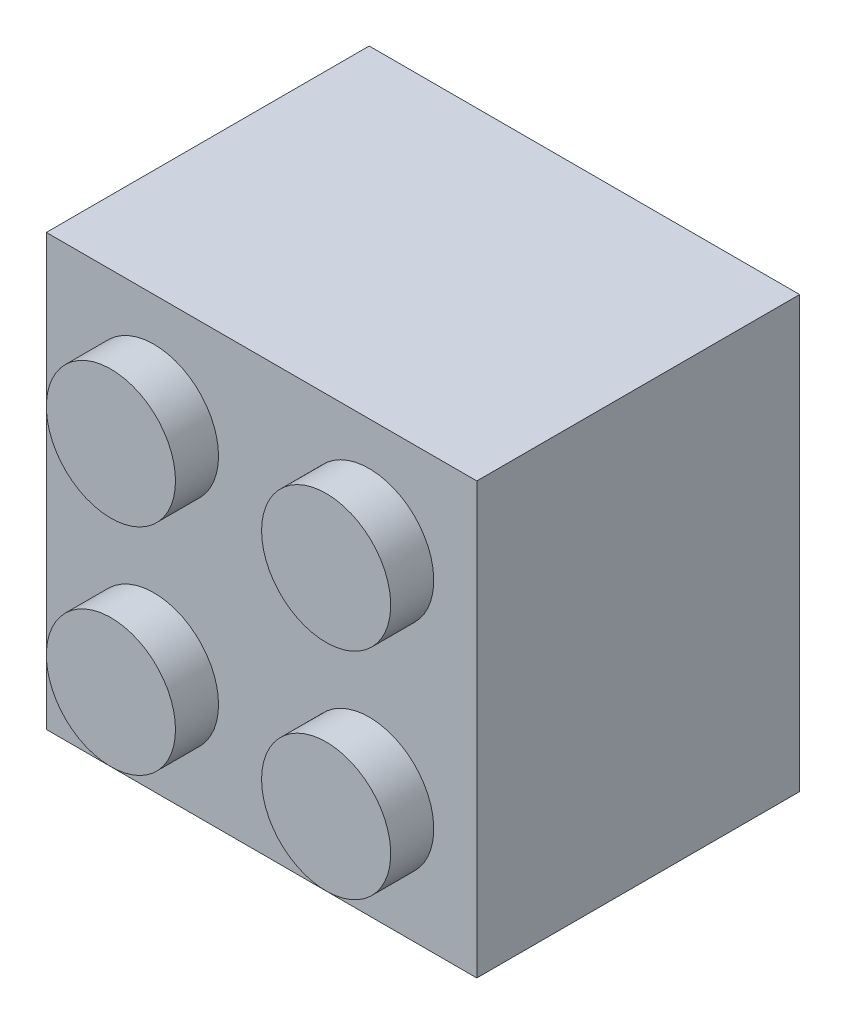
ISO-10303-21;
HEADER;
FILE_DESCRIPTION(('STEP AP214'),'2;1');
FILE_NAME('part.step','',(''),(''),'','','');
FILE_SCHEMA(('AUTOMOTIVE_DESIGN { 1 0 10303 214 1 1 1 1 }'));
ENDSEC;
DATA;
#1=APPLICATION_CONTEXT('core data for automotive mechanical design processes');
#2=APPLICATION_PROTOCOL_DEFINITION('international standard','automotive_design',2000,#1);
#3=PRODUCT_CONTEXT('',#1,'mechanical');
#4=PRODUCT('Part','Part','',(#3));
#5=PRODUCT_RELATED_PRODUCT_CATEGORY('part','',(#4));
#6=PRODUCT_DEFINITION_FORMATION('','',#4);
#7=PRODUCT_DEFINITION_CONTEXT('part definition',#1,'design');
#8=PRODUCT_DEFINITION('design','',#6,#7);
#9=PRODUCT_DEFINITION_SHAPE('','',#8);
#10=(LENGTH_UNIT() NAMED_UNIT(*) SI_UNIT(.MILLI.,.METRE.));
#11=(NAMED_UNIT(*) PLANE_ANGLE_UNIT() SI_UNIT($,.RADIAN.));
#12=(NAMED_UNIT(*) SI_UNIT($,.STERADIAN.) SOLID_ANGLE_UNIT());
#13=UNCERTAINTY_MEASURE_WITH_UNIT(LENGTH_MEASURE(1.E-05),#10,'distance_accuracy_value','');
#14=(GEOMETRIC_REPRESENTATION_CONTEXT(3) GLOBAL_UNCERTAINTY_ASSIGNED_CONTEXT((#13)) GLOBAL_UNIT_ASSIGNED_CONTEXT((#10,
#11,#12)) REPRESENTATION_CONTEXT('',''));
#15=CARTESIAN_POINT('',(0.,0.,0.));
#16=DIRECTION('',(0.,0.,1.));
#17=DIRECTION('',(1.,0.,0.));
#18=AXIS2_PLACEMENT_3D('',#15,#16,#17);
#19=CARTESIAN_POINT('',(0.,0.,19.05));
#20=DIRECTION('',(0.,0.,1.));
#21=DIRECTION('',(1.,0.,0.));
#22=AXIS2_PLACEMENT_3D('',#19,#20,#21);
#23=PLANE('',#22);
#24=DIRECTION('',(0.,-1.,0.));
#25=VECTOR('',#24,1.);
#26=CARTESIAN_POINT('',(-12.7,0.,19.05));
#27=LINE('',#26,#25);
#28=CARTESIAN_POINT('',(-12.7,12.7,19.05));
#29=VERTEX_POINT('',#28);
#30=CARTESIAN_POINT('',(-12.7,-12.7,19.05));
#31=VERTEX_POINT('',#30);
#32=EDGE_CURVE('E32',#29,#31,#27,.T.);
#33=ORIENTED_EDGE('',*,*,#32,.T.);
#34=DIRECTION('',(-1.,0.,0.));
#35=VECTOR('',#34,1.);
#36=CARTESIAN_POINT('',(0.,-12.7,19.05));
#37=LINE('',#36,#35);
#38=CARTESIAN_POINT('',(12.7,-12.7,19.05));
#39=VERTEX_POINT('',#38);
#40=EDGE_CURVE('E267',#39,#31,#37,.T.);
#41=ORIENTED_EDGE('',*,*,#40,.F.);
#42=DIRECTION('',(0.,-1.,0.));
#43=VECTOR('',#42,1.);
#44=CARTESIAN_POINT('',(12.7,0.,19.05));
#45=LINE('',#44,#43);
#46=CARTESIAN_POINT('',(12.7,12.7,19.05));
#47=VERTEX_POINT('',#46);
#48=EDGE_CURVE('E319',#47,#39,#45,.T.);
#49=ORIENTED_EDGE('',*,*,#48,.F.);
#50=DIRECTION('',(-1.,0.,0.));
#51=VECTOR('',#50,1.);
#52=CARTESIAN_POINT('',(0.,12.7,19.05));
#53=LINE('',#52,#51);
#54=EDGE_CURVE('E47',#47,#29,#53,.T.);
#55=ORIENTED_EDGE('',*,*,#54,.T.);
#56=EDGE_LOOP('',(#33,#41,#49,#55));
#57=FACE_BOUND('',#56,.T.);
#58=CARTESIAN_POINT('',(-6.35,6.35,19.05));
#59=DIRECTION('',(0.,0.,1.));
#60=DIRECTION('',(1.,0.,0.));
#61=AXIS2_PLACEMENT_3D('',#58,#59,#60);
#62=CIRCLE('',#61,3.81);
#63=CARTESIAN_POINT('',(-2.54,6.35,19.05));
#64=VERTEX_POINT('',#63);
#65=EDGE_CURVE('E342',#64,#64,#62,.T.);
#66=ORIENTED_EDGE('',*,*,#65,.F.);
#67=EDGE_LOOP('',(#66));
#68=FACE_BOUND('',#67,.T.);
#69=CARTESIAN_POINT('',(6.35,6.35,19.05));
#70=DIRECTION('',(0.,0.,-1.));
#71=DIRECTION('',(-1.,0.,0.));
#72=AXIS2_PLACEMENT_3D('',#69,#70,#71);
#73=CIRCLE('',#72,3.81);
#74=CARTESIAN_POINT('',(2.54,6.35,19.05));
#75=VERTEX_POINT('',#74);
#76=EDGE_CURVE('E293',#75,#75,#73,.T.);
#77=ORIENTED_EDGE('',*,*,#76,.T.);
#78=EDGE_LOOP('',(#77));
#79=FACE_BOUND('',#78,.T.);
#80=CARTESIAN_POINT('',(-6.35,-6.35,19.05));
#81=DIRECTION('',(0.,0.,-1.));
#82=DIRECTION('',(1.,0.,0.));
#83=AXIS2_PLACEMENT_3D('',#80,#81,#82);
#84=CIRCLE('',#83,3.81);
#85=CARTESIAN_POINT('',(-2.54,-6.35,19.05));
#86=VERTEX_POINT('',#85);
#87=EDGE_CURVE('E240',#86,#86,#84,.T.);
#88=ORIENTED_EDGE('',*,*,#87,.T.);
#89=EDGE_LOOP('',(#88));
#90=FACE_BOUND('',#89,.T.);
#91=CARTESIAN_POINT('',(6.35,-6.35,19.05));
#92=DIRECTION('',(0.,0.,1.));
#93=DIRECTION('',(-1.,0.,0.));
#94=AXIS2_PLACEMENT_3D('',#91,#92,#93);
#95=CIRCLE('',#94,3.81);
#96=CARTESIAN_POINT('',(2.54,-6.35,19.05));
#97=VERTEX_POINT('',#96);
#98=EDGE_CURVE('E198',#97,#97,#95,.T.);
#99=ORIENTED_EDGE('',*,*,#98,.F.);
#100=EDGE_LOOP('',(#99));
#101=FACE_BOUND('',#100,.T.);
#102=ADVANCED_FACE('F24',(#57,#68,#79,#90,#101),#23,.T.);
#103=CARTESIAN_POINT('',(0.,12.7,19.05));
#104=DIRECTION('',(0.,-1.,0.));
#105=DIRECTION('',(1.,0.,0.));
#106=AXIS2_PLACEMENT_3D('',#103,#104,#105);
#107=PLANE('',#106);
#108=DIRECTION('',(-1.,0.,0.));
#109=VECTOR('',#108,1.);
#110=CARTESIAN_POINT('',(0.,12.7,0.));
#111=LINE('',#110,#109);
#112=CARTESIAN_POINT('',(12.7,12.7,0.));
#113=VERTEX_POINT('',#112);
#114=CARTESIAN_POINT('',(-12.7,12.7,0.));
#115=VERTEX_POINT('',#114);
#116=EDGE_CURVE('E364',#113,#115,#111,.T.);
#117=ORIENTED_EDGE('',*,*,#116,.T.);
#118=DIRECTION('',(0.,0.,-1.));
#119=VECTOR('',#118,1.);
#120=CARTESIAN_POINT('',(-12.7,12.7,19.05));
#121=LINE('',#120,#119);
#122=EDGE_CURVE('E11',#29,#115,#121,.T.);
#123=ORIENTED_EDGE('',*,*,#122,.F.);
#124=ORIENTED_EDGE('',*,*,#54,.F.);
#125=DIRECTION('',(0.,0.,-1.));
#126=VECTOR('',#125,1.);
#127=CARTESIAN_POINT('',(12.7,12.7,19.05));
#128=LINE('',#127,#126);
#129=EDGE_CURVE('E321',#47,#113,#128,.T.);
#130=ORIENTED_EDGE('',*,*,#129,.T.);
#131=EDGE_LOOP('',(#117,#123,#124,#130));
#132=FACE_BOUND('',#131,.T.);
#133=ADVANCED_FACE('F26',(#132),#107,.F.);
#134=CARTESIAN_POINT('',(-12.7,0.,19.05));
#135=DIRECTION('',(1.,0.,0.));
#136=DIRECTION('',(0.,0.,-1.));
#137=AXIS2_PLACEMENT_3D('',#134,#135,#136);
#138=PLANE('',#137);
#139=DIRECTION('',(0.,-1.,0.));
#140=VECTOR('',#139,1.);
#141=CARTESIAN_POINT('',(-12.7,0.,0.));
#142=LINE('',#141,#140);
#143=CARTESIAN_POINT('',(-12.7,-12.7,0.));
#144=VERTEX_POINT('',#143);
#145=EDGE_CURVE('E366',#115,#144,#142,.T.);
#146=ORIENTED_EDGE('',*,*,#145,.T.);
#147=DIRECTION('',(0.,0.,-1.));
#148=VECTOR('',#147,1.);
#149=CARTESIAN_POINT('',(-12.7,-12.7,19.05));
#150=LINE('',#149,#148);
#151=EDGE_CURVE('E270',#31,#144,#150,.T.);
#152=ORIENTED_EDGE('',*,*,#151,.F.);
#153=ORIENTED_EDGE('',*,*,#32,.F.);
#154=ORIENTED_EDGE('',*,*,#122,.T.);
#155=EDGE_LOOP('',(#146,#152,#153,#154));
#156=FACE_BOUND('',#155,.T.);
#157=ADVANCED_FACE('F373',(#156),#138,.F.);
#158=CARTESIAN_POINT('',(0.,0.,0.));
#159=DIRECTION('',(0.,0.,1.));
#160=DIRECTION('',(1.,0.,0.));
#161=AXIS2_PLACEMENT_3D('',#158,#159,#160);
#162=PLANE('',#161);
#163=DIRECTION('',(1.,0.,0.));
#164=VECTOR('',#163,1.);
#165=CARTESIAN_POINT('',(0.,1.27,0.));
#166=LINE('',#165,#164);
#167=CARTESIAN_POINT('',(-11.43,1.27,0.));
#168=VERTEX_POINT('',#167);
#169=CARTESIAN_POINT('',(-1.27,1.27,0.));
#170=VERTEX_POINT('',#169);
#171=EDGE_CURVE('E329',#168,#170,#166,.T.);
#172=ORIENTED_EDGE('',*,*,#171,.T.);
#173=DIRECTION('',(0.,1.,0.));
#174=VECTOR('',#173,1.);
#175=CARTESIAN_POINT('',(-1.27,0.,0.));
#176=LINE('',#175,#174);
#177=CARTESIAN_POINT('',(-1.27,11.43,0.));
#178=VERTEX_POINT('',#177);
#179=EDGE_CURVE('E350',#170,#178,#176,.T.);
#180=ORIENTED_EDGE('',*,*,#179,.T.);
#181=DIRECTION('',(-1.,0.,0.));
#182=VECTOR('',#181,1.);
#183=CARTESIAN_POINT('',(0.,11.43,0.));
#184=LINE('',#183,#182);
#185=CARTESIAN_POINT('',(-11.43,11.43,0.));
#186=VERTEX_POINT('',#185);
#187=EDGE_CURVE('E353',#178,#186,#184,.T.);
#188=ORIENTED_EDGE('',*,*,#187,.T.);
#189=DIRECTION('',(0.,-1.,0.));
#190=VECTOR('',#189,1.);
#191=CARTESIAN_POINT('',(-11.43,0.,0.));
#192=LINE('',#191,#190);
#193=EDGE_CURVE('E39',#186,#168,#192,.T.);
#194=ORIENTED_EDGE('',*,*,#193,.T.);
#195=EDGE_LOOP('',(#172,#180,#188,#194));
#196=FACE_BOUND('',#195,.T.);
#197=ORIENTED_EDGE('',*,*,#116,.F.);
#198=DIRECTION('',(0.,-1.,0.));
#199=VECTOR('',#198,1.);
#200=CARTESIAN_POINT('',(12.7,0.,0.));
#201=LINE('',#200,#199);
#202=CARTESIAN_POINT('',(12.7,-12.7,0.));
#203=VERTEX_POINT('',#202);
#204=EDGE_CURVE('E317',#113,#203,#201,.T.);
#205=ORIENTED_EDGE('',*,*,#204,.T.);
#206=DIRECTION('',(-1.,0.,0.));
#207=VECTOR('',#206,1.);
#208=CARTESIAN_POINT('',(0.,-12.7,0.));
#209=LINE('',#208,#207);
#210=EDGE_CURVE('E264',#203,#144,#209,.T.);
#211=ORIENTED_EDGE('',*,*,#210,.T.);
#212=ORIENTED_EDGE('',*,*,#145,.F.);
#213=EDGE_LOOP('',(#197,#205,#211,#212));
#214=FACE_BOUND('',#213,.T.);
#215=DIRECTION('',(-1.,0.,0.));
#216=VECTOR('',#215,1.);
#217=CARTESIAN_POINT('',(0.,1.27,0.));
#218=LINE('',#217,#216);
#219=CARTESIAN_POINT('',(11.43,1.27,0.));
#220=VERTEX_POINT('',#219);
#221=CARTESIAN_POINT('',(1.27,1.27,0.));
#222=VERTEX_POINT('',#221);
#223=EDGE_CURVE('E278',#220,#222,#218,.T.);
#224=ORIENTED_EDGE('',*,*,#223,.F.);
#225=DIRECTION('',(0.,-1.,0.));
#226=VECTOR('',#225,1.);
#227=CARTESIAN_POINT('',(11.43,0.,0.));
#228=LINE('',#227,#226);
#229=CARTESIAN_POINT('',(11.43,11.43,0.));
#230=VERTEX_POINT('',#229);
#231=EDGE_CURVE('E307',#230,#220,#228,.T.);
#232=ORIENTED_EDGE('',*,*,#231,.F.);
#233=DIRECTION('',(1.,0.,0.));
#234=VECTOR('',#233,1.);
#235=CARTESIAN_POINT('',(0.,11.43,0.));
#236=LINE('',#235,#234);
#237=CARTESIAN_POINT('',(1.27,11.43,0.));
#238=VERTEX_POINT('',#237);
#239=EDGE_CURVE('E304',#238,#230,#236,.T.);
#240=ORIENTED_EDGE('',*,*,#239,.F.);
#241=DIRECTION('',(0.,1.,0.));
#242=VECTOR('',#241,1.);
#243=CARTESIAN_POINT('',(1.27,0.,0.));
#244=LINE('',#243,#242);
#245=EDGE_CURVE('E301',#222,#238,#244,.T.);
#246=ORIENTED_EDGE('',*,*,#245,.F.);
#247=EDGE_LOOP('',(#224,#232,#240,#246));
#248=FACE_BOUND('',#247,.T.);
#249=DIRECTION('',(1.,0.,0.));
#250=VECTOR('',#249,1.);
#251=CARTESIAN_POINT('',(0.,-1.27,0.));
#252=LINE('',#251,#250);
#253=CARTESIAN_POINT('',(-11.43,-1.27,0.));
#254=VERTEX_POINT('',#253);
#255=CARTESIAN_POINT('',(-1.27,-1.27,0.));
#256=VERTEX_POINT('',#255);
#257=EDGE_CURVE('E225',#254,#256,#252,.T.);
#258=ORIENTED_EDGE('',*,*,#257,.F.);
#259=DIRECTION('',(0.,1.,0.));
#260=VECTOR('',#259,1.);
#261=CARTESIAN_POINT('',(-11.43,0.,0.));
#262=LINE('',#261,#260);
#263=CARTESIAN_POINT('',(-11.43,-11.43,0.));
#264=VERTEX_POINT('',#263);
#265=EDGE_CURVE('E254',#264,#254,#262,.T.);
#266=ORIENTED_EDGE('',*,*,#265,.F.);
#267=DIRECTION('',(-1.,0.,0.));
#268=VECTOR('',#267,1.);
#269=CARTESIAN_POINT('',(0.,-11.43,0.));
#270=LINE('',#269,#268);
#271=CARTESIAN_POINT('',(-1.27,-11.43,0.));
#272=VERTEX_POINT('',#271);
#273=EDGE_CURVE('E251',#272,#264,#270,.T.);
#274=ORIENTED_EDGE('',*,*,#273,.F.);
#275=DIRECTION('',(0.,-1.,0.));
#276=VECTOR('',#275,1.);
#277=CARTESIAN_POINT('',(-1.27,0.,0.));
#278=LINE('',#277,#276);
#279=EDGE_CURVE('E248',#256,#272,#278,.T.);
#280=ORIENTED_EDGE('',*,*,#279,.F.);
#281=EDGE_LOOP('',(#258,#266,#274,#280));
#282=FACE_BOUND('',#281,.T.);
#283=DIRECTION('',(-1.,0.,0.));
#284=VECTOR('',#283,1.);
#285=CARTESIAN_POINT('',(0.,-1.27,0.));
#286=LINE('',#285,#284);
#287=CARTESIAN_POINT('',(11.43,-1.27,0.));
#288=VERTEX_POINT('',#287);
#289=CARTESIAN_POINT('',(1.27,-1.27,0.));
#290=VERTEX_POINT('',#289);
#291=EDGE_CURVE('E207',#288,#290,#286,.T.);
#292=ORIENTED_EDGE('',*,*,#291,.T.);
#293=DIRECTION('',(0.,-1.,0.));
#294=VECTOR('',#293,1.);
#295=CARTESIAN_POINT('',(1.27,0.,0.));
#296=LINE('',#295,#294);
#297=CARTESIAN_POINT('',(1.27,-11.43,0.));
#298=VERTEX_POINT('',#297);
#299=EDGE_CURVE('E203',#290,#298,#296,.T.);
#300=ORIENTED_EDGE('',*,*,#299,.T.);
#301=DIRECTION('',(1.,0.,0.));
#302=VECTOR('',#301,1.);
#303=CARTESIAN_POINT('',(0.,-11.43,0.));
#304=LINE('',#303,#302);
#305=CARTESIAN_POINT('',(11.43,-11.43,0.));
#306=VERTEX_POINT('',#305);
#307=EDGE_CURVE('E206',#298,#306,#304,.T.);
#308=ORIENTED_EDGE('',*,*,#307,.T.);
#309=DIRECTION('',(0.,1.,0.));
#310=VECTOR('',#309,1.);
#311=CARTESIAN_POINT('',(11.43,0.,0.));
#312=LINE('',#311,#310);
#313=EDGE_CURVE('E169',#306,#288,#312,.T.);
#314=ORIENTED_EDGE('',*,*,#313,.T.);
#315=EDGE_LOOP('',(#292,#300,#308,#314));
#316=FACE_BOUND('',#315,.T.);
#317=ADVANCED_FACE('F385',(#196,#214,#248,#282,#316),#162,.F.);
#318=CARTESIAN_POINT('',(-6.35,6.35,21.59));
#319=DIRECTION('',(0.,0.,-1.));
#320=DIRECTION('',(-1.,0.,0.));
#321=AXIS2_PLACEMENT_3D('',#318,#319,#320);
#322=CYLINDRICAL_SURFACE('',#321,3.81);
#323=CARTESIAN_POINT('',(-6.35,6.35,21.59));
#324=DIRECTION('',(0.,0.,1.));
#325=DIRECTION('',(1.,0.,0.));
#326=AXIS2_PLACEMENT_3D('',#323,#324,#325);
#327=CIRCLE('',#326,3.81);
#328=CARTESIAN_POINT('',(-2.54,6.35,21.59));
#329=VERTEX_POINT('',#328);
#330=EDGE_CURVE('E361',#329,#329,#327,.T.);
#331=ORIENTED_EDGE('',*,*,#330,.F.);
#332=EDGE_LOOP('',(#331));
#333=FACE_BOUND('',#332,.T.);
#334=ORIENTED_EDGE('',*,*,#65,.T.);
#335=EDGE_LOOP('',(#334));
#336=FACE_BOUND('',#335,.T.);
#337=ADVANCED_FACE('F388',(#333,#336),#322,.T.);
#338=CARTESIAN_POINT('',(-6.35,6.35,21.59));
#339=DIRECTION('',(0.,0.,1.));
#340=DIRECTION('',(1.,0.,0.));
#341=AXIS2_PLACEMENT_3D('',#338,#339,#340);
#342=PLANE('',#341);
#343=ORIENTED_EDGE('',*,*,#330,.T.);
#344=EDGE_LOOP('',(#343));
#345=FACE_BOUND('',#344,.T.);
#346=ADVANCED_FACE('F614',(#345),#342,.T.);
#347=CARTESIAN_POINT('',(0.,0.,17.78));
#348=DIRECTION('',(0.,0.,1.));
#349=DIRECTION('',(1.,0.,0.));
#350=AXIS2_PLACEMENT_3D('',#347,#348,#349);
#351=PLANE('',#350);
#352=DIRECTION('',(0.,1.,0.));
#353=VECTOR('',#352,1.);
#354=CARTESIAN_POINT('',(-1.27,0.,17.78));
#355=LINE('',#354,#353);
#356=CARTESIAN_POINT('',(-1.27,1.27,17.78));
#357=VERTEX_POINT('',#356);
#358=CARTESIAN_POINT('',(-1.27,11.43,17.78));
#359=VERTEX_POINT('',#358);
#360=EDGE_CURVE('E325',#357,#359,#355,.T.);
#361=ORIENTED_EDGE('',*,*,#360,.F.);
#362=DIRECTION('',(1.,0.,0.));
#363=VECTOR('',#362,1.);
#364=CARTESIAN_POINT('',(0.,1.27,17.78));
#365=LINE('',#364,#363);
#366=CARTESIAN_POINT('',(-11.43,1.27,17.78));
#367=VERTEX_POINT('',#366);
#368=EDGE_CURVE('E333',#367,#357,#365,.T.);
#369=ORIENTED_EDGE('',*,*,#368,.F.);
#370=DIRECTION('',(0.,-1.,0.));
#371=VECTOR('',#370,1.);
#372=CARTESIAN_POINT('',(-11.43,0.,17.78));
#373=LINE('',#372,#371);
#374=CARTESIAN_POINT('',(-11.43,11.43,17.78));
#375=VERTEX_POINT('',#374);
#376=EDGE_CURVE('E331',#375,#367,#373,.T.);
#377=ORIENTED_EDGE('',*,*,#376,.F.);
#378=DIRECTION('',(-1.,0.,0.));
#379=VECTOR('',#378,1.);
#380=CARTESIAN_POINT('',(0.,11.43,17.78));
#381=LINE('',#380,#379);
#382=EDGE_CURVE('E328',#359,#375,#381,.T.);
#383=ORIENTED_EDGE('',*,*,#382,.F.);
#384=EDGE_LOOP('',(#361,#369,#377,#383));
#385=FACE_BOUND('',#384,.T.);
#386=CARTESIAN_POINT('',(-6.35,6.35,17.78));
#387=DIRECTION('',(0.,0.,1.));
#388=DIRECTION('',(1.,0.,0.));
#389=AXIS2_PLACEMENT_3D('',#386,#387,#388);
#390=CIRCLE('',#389,2.54);
#391=CARTESIAN_POINT('',(-3.81,6.35,17.78));
#392=VERTEX_POINT('',#391);
#393=EDGE_CURVE('E324',#392,#392,#390,.T.);
#394=ORIENTED_EDGE('',*,*,#393,.T.);
#395=EDGE_LOOP('',(#394));
#396=FACE_BOUND('',#395,.T.);
#397=ADVANCED_FACE('F610',(#385,#396),#351,.F.);
#398=CARTESIAN_POINT('',(-1.27,0.,19.05));
#399=DIRECTION('',(-1.,0.,0.));
#400=DIRECTION('',(0.,0.,1.));
#401=AXIS2_PLACEMENT_3D('',#398,#399,#400);
#402=PLANE('',#401);
#403=ORIENTED_EDGE('',*,*,#179,.F.);
#404=DIRECTION('',(0.,0.,-1.));
#405=VECTOR('',#404,1.);
#406=CARTESIAN_POINT('',(-1.27,1.27,19.05));
#407=LINE('',#406,#405);
#408=EDGE_CURVE('E335',#357,#170,#407,.T.);
#409=ORIENTED_EDGE('',*,*,#408,.F.);
#410=ORIENTED_EDGE('',*,*,#360,.T.);
#411=DIRECTION('',(0.,0.,-1.));
#412=VECTOR('',#411,1.);
#413=CARTESIAN_POINT('',(-1.27,11.43,19.05));
#414=LINE('',#413,#412);
#415=EDGE_CURVE('E339',#359,#178,#414,.T.);
#416=ORIENTED_EDGE('',*,*,#415,.T.);
#417=EDGE_LOOP('',(#403,#409,#410,#416));
#418=FACE_BOUND('',#417,.T.);
#419=ADVANCED_FACE('F613',(#418),#402,.T.);
#420=CARTESIAN_POINT('',(0.,11.43,19.05));
#421=DIRECTION('',(0.,-1.,0.));
#422=DIRECTION('',(1.,0.,0.));
#423=AXIS2_PLACEMENT_3D('',#420,#421,#422);
#424=PLANE('',#423);
#425=ORIENTED_EDGE('',*,*,#187,.F.);
#426=ORIENTED_EDGE('',*,*,#415,.F.);
#427=ORIENTED_EDGE('',*,*,#382,.T.);
#428=DIRECTION('',(0.,0.,-1.));
#429=VECTOR('',#428,1.);
#430=CARTESIAN_POINT('',(-11.43,11.43,19.05));
#431=LINE('',#430,#429);
#432=EDGE_CURVE('E343',#375,#186,#431,.T.);
#433=ORIENTED_EDGE('',*,*,#432,.T.);
#434=EDGE_LOOP('',(#425,#426,#427,#433));
#435=FACE_BOUND('',#434,.T.);
#436=ADVANCED_FACE('F618',(#435),#424,.T.);
#437=CARTESIAN_POINT('',(-11.43,0.,19.05));
#438=DIRECTION('',(1.,0.,0.));
#439=DIRECTION('',(0.,0.,-1.));
#440=AXIS2_PLACEMENT_3D('',#437,#438,#439);
#441=PLANE('',#440);
#442=ORIENTED_EDGE('',*,*,#193,.F.);
#443=ORIENTED_EDGE('',*,*,#432,.F.);
#444=ORIENTED_EDGE('',*,*,#376,.T.);
#445=DIRECTION('',(0.,0.,-1.));
#446=VECTOR('',#445,1.);
#447=CARTESIAN_POINT('',(-11.43,1.27,19.05));
#448=LINE('',#447,#446);
#449=EDGE_CURVE('E345',#367,#168,#448,.T.);
#450=ORIENTED_EDGE('',*,*,#449,.T.);
#451=EDGE_LOOP('',(#442,#443,#444,#450));
#452=FACE_BOUND('',#451,.T.);
#453=ADVANCED_FACE('F622',(#452),#441,.T.);
#454=CARTESIAN_POINT('',(0.,1.27,19.05));
#455=DIRECTION('',(0.,1.,0.));
#456=DIRECTION('',(-1.,0.,0.));
#457=AXIS2_PLACEMENT_3D('',#454,#455,#456);
#458=PLANE('',#457);
#459=ORIENTED_EDGE('',*,*,#171,.F.);
#460=ORIENTED_EDGE('',*,*,#449,.F.);
#461=ORIENTED_EDGE('',*,*,#368,.T.);
#462=ORIENTED_EDGE('',*,*,#408,.T.);
#463=EDGE_LOOP('',(#459,#460,#461,#462));
#464=FACE_BOUND('',#463,.T.);
#465=ADVANCED_FACE('F626',(#464),#458,.T.);
#466=CARTESIAN_POINT('',(-6.35,6.35,21.59));
#467=DIRECTION('',(0.,0.,-1.));
#468=DIRECTION('',(-1.,0.,0.));
#469=AXIS2_PLACEMENT_3D('',#466,#467,#468);
#470=CYLINDRICAL_SURFACE('',#469,2.54);
#471=CARTESIAN_POINT('',(-6.35,6.35,20.32));
#472=DIRECTION('',(0.,0.,1.));
#473=DIRECTION('',(1.,0.,0.));
#474=AXIS2_PLACEMENT_3D('',#471,#472,#473);
#475=CIRCLE('',#474,2.54);
#476=CARTESIAN_POINT('',(-3.81,6.35,20.32));
#477=VERTEX_POINT('',#476);
#478=EDGE_CURVE('E338',#477,#477,#475,.T.);
#479=ORIENTED_EDGE('',*,*,#478,.T.);
#480=EDGE_LOOP('',(#479));
#481=FACE_BOUND('',#480,.T.);
#482=ORIENTED_EDGE('',*,*,#393,.F.);
#483=EDGE_LOOP('',(#482));
#484=FACE_BOUND('',#483,.T.);
#485=ADVANCED_FACE('F629',(#481,#484),#470,.F.);
#486=CARTESIAN_POINT('',(-6.35,6.35,20.32));
#487=DIRECTION('',(0.,0.,1.));
#488=DIRECTION('',(1.,0.,0.));
#489=AXIS2_PLACEMENT_3D('',#486,#487,#488);
#490=PLANE('',#489);
#491=ORIENTED_EDGE('',*,*,#478,.F.);
#492=EDGE_LOOP('',(#491));
#493=FACE_BOUND('',#492,.T.);
#494=ADVANCED_FACE('F437',(#493),#490,.F.);
#495=CARTESIAN_POINT('',(12.7,0.,19.05));
#496=DIRECTION('',(-1.,0.,0.));
#497=DIRECTION('',(0.,0.,-1.));
#498=AXIS2_PLACEMENT_3D('',#495,#496,#497);
#499=PLANE('',#498);
#500=ORIENTED_EDGE('',*,*,#204,.F.);
#501=ORIENTED_EDGE('',*,*,#129,.F.);
#502=ORIENTED_EDGE('',*,*,#48,.T.);
#503=DIRECTION('',(0.,0.,-1.));
#504=VECTOR('',#503,1.);
#505=CARTESIAN_POINT('',(12.7,-12.7,19.05));
#506=LINE('',#505,#504);
#507=EDGE_CURVE('E217',#39,#203,#506,.T.);
#508=ORIENTED_EDGE('',*,*,#507,.T.);
#509=EDGE_LOOP('',(#500,#501,#502,#508));
#510=FACE_BOUND('',#509,.T.);
#511=ADVANCED_FACE('F381',(#510),#499,.F.);
#512=CARTESIAN_POINT('',(6.35,6.35,21.59));
#513=DIRECTION('',(0.,0.,-1.));
#514=DIRECTION('',(1.,0.,0.));
#515=AXIS2_PLACEMENT_3D('',#512,#513,#514);
#516=CYLINDRICAL_SURFACE('',#515,3.81);
#517=CARTESIAN_POINT('',(6.35,6.35,21.59));
#518=DIRECTION('',(0.,0.,-1.));
#519=DIRECTION('',(-1.,0.,0.));
#520=AXIS2_PLACEMENT_3D('',#517,#518,#519);
#521=CIRCLE('',#520,3.81);
#522=CARTESIAN_POINT('',(2.54,6.35,21.59));
#523=VERTEX_POINT('',#522);
#524=EDGE_CURVE('E314',#523,#523,#521,.T.);
#525=ORIENTED_EDGE('',*,*,#524,.T.);
#526=EDGE_LOOP('',(#525));
#527=FACE_BOUND('',#526,.T.);
#528=ORIENTED_EDGE('',*,*,#76,.F.);
#529=EDGE_LOOP('',(#528));
#530=FACE_BOUND('',#529,.T.);
#531=ADVANCED_FACE('F436',(#527,#530),#516,.T.);
#532=CARTESIAN_POINT('',(6.35,6.35,21.59));
#533=DIRECTION('',(0.,0.,1.));
#534=DIRECTION('',(-1.,0.,0.));
#535=AXIS2_PLACEMENT_3D('',#532,#533,#534);
#536=PLANE('',#535);
#537=ORIENTED_EDGE('',*,*,#524,.F.);
#538=EDGE_LOOP('',(#537));
#539=FACE_BOUND('',#538,.T.);
#540=ADVANCED_FACE('F580',(#539),#536,.T.);
#541=CARTESIAN_POINT('',(0.,0.,17.78));
#542=DIRECTION('',(0.,0.,1.));
#543=DIRECTION('',(-1.,0.,0.));
#544=AXIS2_PLACEMENT_3D('',#541,#542,#543);
#545=PLANE('',#544);
#546=DIRECTION('',(0.,1.,0.));
#547=VECTOR('',#546,1.);
#548=CARTESIAN_POINT('',(1.27,0.,17.78));
#549=LINE('',#548,#547);
#550=CARTESIAN_POINT('',(1.27,1.27,17.78));
#551=VERTEX_POINT('',#550);
#552=CARTESIAN_POINT('',(1.27,11.43,17.78));
#553=VERTEX_POINT('',#552);
#554=EDGE_CURVE('E274',#551,#553,#549,.T.);
#555=ORIENTED_EDGE('',*,*,#554,.T.);
#556=DIRECTION('',(1.,0.,0.));
#557=VECTOR('',#556,1.);
#558=CARTESIAN_POINT('',(0.,11.43,17.78));
#559=LINE('',#558,#557);
#560=CARTESIAN_POINT('',(11.43,11.43,17.78));
#561=VERTEX_POINT('',#560);
#562=EDGE_CURVE('E277',#553,#561,#559,.T.);
#563=ORIENTED_EDGE('',*,*,#562,.T.);
#564=DIRECTION('',(0.,-1.,0.));
#565=VECTOR('',#564,1.);
#566=CARTESIAN_POINT('',(11.43,0.,17.78));
#567=LINE('',#566,#565);
#568=CARTESIAN_POINT('',(11.43,1.27,17.78));
#569=VERTEX_POINT('',#568);
#570=EDGE_CURVE('E281',#561,#569,#567,.T.);
#571=ORIENTED_EDGE('',*,*,#570,.T.);
#572=DIRECTION('',(-1.,0.,0.));
#573=VECTOR('',#572,1.);
#574=CARTESIAN_POINT('',(0.,1.27,17.78));
#575=LINE('',#574,#573);
#576=EDGE_CURVE('E284',#569,#551,#575,.T.);
#577=ORIENTED_EDGE('',*,*,#576,.T.);
#578=EDGE_LOOP('',(#555,#563,#571,#577));
#579=FACE_BOUND('',#578,.T.);
#580=CARTESIAN_POINT('',(6.35,6.35,17.78));
#581=DIRECTION('',(0.,0.,-1.));
#582=DIRECTION('',(-1.,0.,0.));
#583=AXIS2_PLACEMENT_3D('',#580,#581,#582);
#584=CIRCLE('',#583,2.54);
#585=CARTESIAN_POINT('',(3.81,6.35,17.78));
#586=VERTEX_POINT('',#585);
#587=EDGE_CURVE('E273',#586,#586,#584,.T.);
#588=ORIENTED_EDGE('',*,*,#587,.F.);
#589=EDGE_LOOP('',(#588));
#590=FACE_BOUND('',#589,.T.);
#591=ADVANCED_FACE('F576',(#579,#590),#545,.F.);
#592=CARTESIAN_POINT('',(1.27,0.,19.05));
#593=DIRECTION('',(1.,0.,0.));
#594=DIRECTION('',(0.,0.,1.));
#595=AXIS2_PLACEMENT_3D('',#592,#593,#594);
#596=PLANE('',#595);
#597=ORIENTED_EDGE('',*,*,#245,.T.);
#598=DIRECTION('',(0.,0.,-1.));
#599=VECTOR('',#598,1.);
#600=CARTESIAN_POINT('',(1.27,11.43,19.05));
#601=LINE('',#600,#599);
#602=EDGE_CURVE('E291',#553,#238,#601,.T.);
#603=ORIENTED_EDGE('',*,*,#602,.F.);
#604=ORIENTED_EDGE('',*,*,#554,.F.);
#605=DIRECTION('',(0.,0.,-1.));
#606=VECTOR('',#605,1.);
#607=CARTESIAN_POINT('',(1.27,1.27,19.05));
#608=LINE('',#607,#606);
#609=EDGE_CURVE('E287',#551,#222,#608,.T.);
#610=ORIENTED_EDGE('',*,*,#609,.T.);
#611=EDGE_LOOP('',(#597,#603,#604,#610));
#612=FACE_BOUND('',#611,.T.);
#613=ADVANCED_FACE('F579',(#612),#596,.T.);
#614=CARTESIAN_POINT('',(0.,11.43,19.05));
#615=DIRECTION('',(0.,-1.,0.));
#616=DIRECTION('',(-1.,0.,0.));
#617=AXIS2_PLACEMENT_3D('',#614,#615,#616);
#618=PLANE('',#617);
#619=ORIENTED_EDGE('',*,*,#239,.T.);
#620=DIRECTION('',(0.,0.,-1.));
#621=VECTOR('',#620,1.);
#622=CARTESIAN_POINT('',(11.43,11.43,19.05));
#623=LINE('',#622,#621);
#624=EDGE_CURVE('E294',#561,#230,#623,.T.);
#625=ORIENTED_EDGE('',*,*,#624,.F.);
#626=ORIENTED_EDGE('',*,*,#562,.F.);
#627=ORIENTED_EDGE('',*,*,#602,.T.);
#628=EDGE_LOOP('',(#619,#625,#626,#627));
#629=FACE_BOUND('',#628,.T.);
#630=ADVANCED_FACE('F584',(#629),#618,.T.);
#631=CARTESIAN_POINT('',(11.43,0.,19.05));
#632=DIRECTION('',(-1.,0.,0.));
#633=DIRECTION('',(0.,0.,-1.));
#634=AXIS2_PLACEMENT_3D('',#631,#632,#633);
#635=PLANE('',#634);
#636=ORIENTED_EDGE('',*,*,#231,.T.);
#637=DIRECTION('',(0.,0.,-1.));
#638=VECTOR('',#637,1.);
#639=CARTESIAN_POINT('',(11.43,1.27,19.05));
#640=LINE('',#639,#638);
#641=EDGE_CURVE('E296',#569,#220,#640,.T.);
#642=ORIENTED_EDGE('',*,*,#641,.F.);
#643=ORIENTED_EDGE('',*,*,#570,.F.);
#644=ORIENTED_EDGE('',*,*,#624,.T.);
#645=EDGE_LOOP('',(#636,#642,#643,#644));
#646=FACE_BOUND('',#645,.T.);
#647=ADVANCED_FACE('F588',(#646),#635,.T.);
#648=CARTESIAN_POINT('',(0.,1.27,19.05));
#649=DIRECTION('',(0.,1.,0.));
#650=DIRECTION('',(1.,0.,0.));
#651=AXIS2_PLACEMENT_3D('',#648,#649,#650);
#652=PLANE('',#651);
#653=ORIENTED_EDGE('',*,*,#223,.T.);
#654=ORIENTED_EDGE('',*,*,#609,.F.);
#655=ORIENTED_EDGE('',*,*,#576,.F.);
#656=ORIENTED_EDGE('',*,*,#641,.T.);
#657=EDGE_LOOP('',(#653,#654,#655,#656));
#658=FACE_BOUND('',#657,.T.);
#659=ADVANCED_FACE('F592',(#658),#652,.T.);
#660=CARTESIAN_POINT('',(6.35,6.35,21.59));
#661=DIRECTION('',(0.,0.,-1.));
#662=DIRECTION('',(1.,0.,0.));
#663=AXIS2_PLACEMENT_3D('',#660,#661,#662);
#664=CYLINDRICAL_SURFACE('',#663,2.54);
#665=CARTESIAN_POINT('',(6.35,6.35,20.32));
#666=DIRECTION('',(0.,0.,-1.));
#667=DIRECTION('',(-1.,0.,0.));
#668=AXIS2_PLACEMENT_3D('',#665,#666,#667);
#669=CIRCLE('',#668,2.54);
#670=CARTESIAN_POINT('',(3.81,6.35,20.32));
#671=VERTEX_POINT('',#670);
#672=EDGE_CURVE('E290',#671,#671,#669,.T.);
#673=ORIENTED_EDGE('',*,*,#672,.F.);
#674=EDGE_LOOP('',(#673));
#675=FACE_BOUND('',#674,.T.);
#676=ORIENTED_EDGE('',*,*,#587,.T.);
#677=EDGE_LOOP('',(#676));
#678=FACE_BOUND('',#677,.T.);
#679=ADVANCED_FACE('F596',(#675,#678),#664,.F.);
#680=CARTESIAN_POINT('',(6.35,6.35,20.32));
#681=DIRECTION('',(0.,0.,1.));
#682=DIRECTION('',(-1.,0.,0.));
#683=AXIS2_PLACEMENT_3D('',#680,#681,#682);
#684=PLANE('',#683);
#685=ORIENTED_EDGE('',*,*,#672,.T.);
#686=EDGE_LOOP('',(#685));
#687=FACE_BOUND('',#686,.T.);
#688=ADVANCED_FACE('F447',(#687),#684,.F.);
#689=CARTESIAN_POINT('',(0.,-12.7,19.05));
#690=DIRECTION('',(0.,1.,0.));
#691=DIRECTION('',(1.,0.,0.));
#692=AXIS2_PLACEMENT_3D('',#689,#690,#691);
#693=PLANE('',#692);
#694=ORIENTED_EDGE('',*,*,#210,.F.);
#695=ORIENTED_EDGE('',*,*,#507,.F.);
#696=ORIENTED_EDGE('',*,*,#40,.T.);
#697=ORIENTED_EDGE('',*,*,#151,.T.);
#698=EDGE_LOOP('',(#694,#695,#696,#697));
#699=FACE_BOUND('',#698,.T.);
#700=ADVANCED_FACE('F378',(#699),#693,.F.);
#701=CARTESIAN_POINT('',(-6.35,-6.35,21.59));
#702=DIRECTION('',(0.,0.,-1.));
#703=DIRECTION('',(-1.,0.,0.));
#704=AXIS2_PLACEMENT_3D('',#701,#702,#703);
#705=CYLINDRICAL_SURFACE('',#704,3.81);
#706=CARTESIAN_POINT('',(-6.35,-6.35,21.59));
#707=DIRECTION('',(0.,0.,-1.));
#708=DIRECTION('',(1.,0.,0.));
#709=AXIS2_PLACEMENT_3D('',#706,#707,#708);
#710=CIRCLE('',#709,3.81);
#711=CARTESIAN_POINT('',(-2.54,-6.35,21.59));
#712=VERTEX_POINT('',#711);
#713=EDGE_CURVE('E261',#712,#712,#710,.T.);
#714=ORIENTED_EDGE('',*,*,#713,.T.);
#715=EDGE_LOOP('',(#714));
#716=FACE_BOUND('',#715,.T.);
#717=ORIENTED_EDGE('',*,*,#87,.F.);
#718=EDGE_LOOP('',(#717));
#719=FACE_BOUND('',#718,.T.);
#720=ADVANCED_FACE('F446',(#716,#719),#705,.T.);
#721=CARTESIAN_POINT('',(-6.35,-6.35,21.59));
#722=DIRECTION('',(0.,0.,1.));
#723=DIRECTION('',(1.,0.,0.));
#724=AXIS2_PLACEMENT_3D('',#721,#722,#723);
#725=PLANE('',#724);
#726=ORIENTED_EDGE('',*,*,#713,.F.);
#727=EDGE_LOOP('',(#726));
#728=FACE_BOUND('',#727,.T.);
#729=ADVANCED_FACE('F454',(#728),#725,.T.);
#730=CARTESIAN_POINT('',(0.,0.,17.78));
#731=DIRECTION('',(0.,0.,1.));
#732=DIRECTION('',(1.,0.,0.));
#733=AXIS2_PLACEMENT_3D('',#730,#731,#732);
#734=PLANE('',#733);
#735=DIRECTION('',(0.,-1.,0.));
#736=VECTOR('',#735,1.);
#737=CARTESIAN_POINT('',(-1.27,0.,17.78));
#738=LINE('',#737,#736);
#739=CARTESIAN_POINT('',(-1.27,-1.27,17.78));
#740=VERTEX_POINT('',#739);
#741=CARTESIAN_POINT('',(-1.27,-11.43,17.78));
#742=VERTEX_POINT('',#741);
#743=EDGE_CURVE('E221',#740,#742,#738,.T.);
#744=ORIENTED_EDGE('',*,*,#743,.T.);
#745=DIRECTION('',(-1.,0.,0.));
#746=VECTOR('',#745,1.);
#747=CARTESIAN_POINT('',(0.,-11.43,17.78));
#748=LINE('',#747,#746);
#749=CARTESIAN_POINT('',(-11.43,-11.43,17.78));
#750=VERTEX_POINT('',#749);
#751=EDGE_CURVE('E224',#742,#750,#748,.T.);
#752=ORIENTED_EDGE('',*,*,#751,.T.);
#753=DIRECTION('',(0.,1.,0.));
#754=VECTOR('',#753,1.);
#755=CARTESIAN_POINT('',(-11.43,0.,17.78));
#756=LINE('',#755,#754);
#757=CARTESIAN_POINT('',(-11.43,-1.27,17.78));
#758=VERTEX_POINT('',#757);
#759=EDGE_CURVE('E228',#750,#758,#756,.T.);
#760=ORIENTED_EDGE('',*,*,#759,.T.);
#761=DIRECTION('',(1.,0.,0.));
#762=VECTOR('',#761,1.);
#763=CARTESIAN_POINT('',(0.,-1.27,17.78));
#764=LINE('',#763,#762);
#765=EDGE_CURVE('E231',#758,#740,#764,.T.);
#766=ORIENTED_EDGE('',*,*,#765,.T.);
#767=EDGE_LOOP('',(#744,#752,#760,#766));
#768=FACE_BOUND('',#767,.T.);
#769=CARTESIAN_POINT('',(-6.35,-6.35,17.78));
#770=DIRECTION('',(0.,0.,-1.));
#771=DIRECTION('',(1.,0.,0.));
#772=AXIS2_PLACEMENT_3D('',#769,#770,#771);
#773=CIRCLE('',#772,2.54);
#774=CARTESIAN_POINT('',(-3.81,-6.35,17.78));
#775=VERTEX_POINT('',#774);
#776=EDGE_CURVE('E220',#775,#775,#773,.T.);
#777=ORIENTED_EDGE('',*,*,#776,.F.);
#778=EDGE_LOOP('',(#777));
#779=FACE_BOUND('',#778,.T.);
#780=ADVANCED_FACE('F462',(#768,#779),#734,.F.);
#781=CARTESIAN_POINT('',(-1.27,0.,19.05));
#782=DIRECTION('',(-1.,0.,0.));
#783=DIRECTION('',(0.,0.,1.));
#784=AXIS2_PLACEMENT_3D('',#781,#782,#783);
#785=PLANE('',#784);
#786=ORIENTED_EDGE('',*,*,#279,.T.);
#787=DIRECTION('',(0.,0.,-1.));
#788=VECTOR('',#787,1.);
#789=CARTESIAN_POINT('',(-1.27,-11.43,19.05));
#790=LINE('',#789,#788);
#791=EDGE_CURVE('E238',#742,#272,#790,.T.);
#792=ORIENTED_EDGE('',*,*,#791,.F.);
#793=ORIENTED_EDGE('',*,*,#743,.F.);
#794=DIRECTION('',(0.,0.,-1.));
#795=VECTOR('',#794,1.);
#796=CARTESIAN_POINT('',(-1.27,-1.27,19.05));
#797=LINE('',#796,#795);
#798=EDGE_CURVE('E234',#740,#256,#797,.T.);
#799=ORIENTED_EDGE('',*,*,#798,.T.);
#800=EDGE_LOOP('',(#786,#792,#793,#799));
#801=FACE_BOUND('',#800,.T.);
#802=ADVANCED_FACE('F470',(#801),#785,.T.);
#803=CARTESIAN_POINT('',(0.,-11.43,19.05));
#804=DIRECTION('',(0.,1.,0.));
#805=DIRECTION('',(1.,0.,0.));
#806=AXIS2_PLACEMENT_3D('',#803,#804,#805);
#807=PLANE('',#806);
#808=ORIENTED_EDGE('',*,*,#273,.T.);
#809=DIRECTION('',(0.,0.,-1.));
#810=VECTOR('',#809,1.);
#811=CARTESIAN_POINT('',(-11.43,-11.43,19.05));
#812=LINE('',#811,#810);
#813=EDGE_CURVE('E241',#750,#264,#812,.T.);
#814=ORIENTED_EDGE('',*,*,#813,.F.);
#815=ORIENTED_EDGE('',*,*,#751,.F.);
#816=ORIENTED_EDGE('',*,*,#791,.T.);
#817=EDGE_LOOP('',(#808,#814,#815,#816));
#818=FACE_BOUND('',#817,.T.);
#819=ADVANCED_FACE('F478',(#818),#807,.T.);
#820=CARTESIAN_POINT('',(-11.43,0.,19.05));
#821=DIRECTION('',(1.,0.,0.));
#822=DIRECTION('',(0.,0.,-1.));
#823=AXIS2_PLACEMENT_3D('',#820,#821,#822);
#824=PLANE('',#823);
#825=ORIENTED_EDGE('',*,*,#265,.T.);
#826=DIRECTION('',(0.,0.,-1.));
#827=VECTOR('',#826,1.);
#828=CARTESIAN_POINT('',(-11.43,-1.27,19.05));
#829=LINE('',#828,#827);
#830=EDGE_CURVE('E243',#758,#254,#829,.T.);
#831=ORIENTED_EDGE('',*,*,#830,.F.);
#832=ORIENTED_EDGE('',*,*,#759,.F.);
#833=ORIENTED_EDGE('',*,*,#813,.T.);
#834=EDGE_LOOP('',(#825,#831,#832,#833));
#835=FACE_BOUND('',#834,.T.);
#836=ADVANCED_FACE('F486',(#835),#824,.T.);
#837=CARTESIAN_POINT('',(0.,-1.27,19.05));
#838=DIRECTION('',(0.,-1.,0.));
#839=DIRECTION('',(-1.,0.,0.));
#840=AXIS2_PLACEMENT_3D('',#837,#838,#839);
#841=PLANE('',#840);
#842=ORIENTED_EDGE('',*,*,#257,.T.);
#843=ORIENTED_EDGE('',*,*,#798,.F.);
#844=ORIENTED_EDGE('',*,*,#765,.F.);
#845=ORIENTED_EDGE('',*,*,#830,.T.);
#846=EDGE_LOOP('',(#842,#843,#844,#845));
#847=FACE_BOUND('',#846,.T.);
#848=ADVANCED_FACE('F494',(#847),#841,.T.);
#849=CARTESIAN_POINT('',(-6.35,-6.35,21.59));
#850=DIRECTION('',(0.,0.,-1.));
#851=DIRECTION('',(-1.,0.,0.));
#852=AXIS2_PLACEMENT_3D('',#849,#850,#851);
#853=CYLINDRICAL_SURFACE('',#852,2.54);
#854=CARTESIAN_POINT('',(-6.35,-6.35,20.32));
#855=DIRECTION('',(0.,0.,-1.));
#856=DIRECTION('',(1.,0.,0.));
#857=AXIS2_PLACEMENT_3D('',#854,#855,#856);
#858=CIRCLE('',#857,2.54);
#859=CARTESIAN_POINT('',(-3.81,-6.35,20.32));
#860=VERTEX_POINT('',#859);
#861=EDGE_CURVE('E237',#860,#860,#858,.T.);
#862=ORIENTED_EDGE('',*,*,#861,.F.);
#863=EDGE_LOOP('',(#862));
#864=FACE_BOUND('',#863,.T.);
#865=ORIENTED_EDGE('',*,*,#776,.T.);
#866=EDGE_LOOP('',(#865));
#867=FACE_BOUND('',#866,.T.);
#868=ADVANCED_FACE('F502',(#864,#867),#853,.F.);
#869=CARTESIAN_POINT('',(-6.35,-6.35,20.32));
#870=DIRECTION('',(0.,0.,1.));
#871=DIRECTION('',(1.,0.,0.));
#872=AXIS2_PLACEMENT_3D('',#869,#870,#871);
#873=PLANE('',#872);
#874=ORIENTED_EDGE('',*,*,#861,.T.);
#875=EDGE_LOOP('',(#874));
#876=FACE_BOUND('',#875,.T.);
#877=ADVANCED_FACE('F510',(#876),#873,.F.);
#878=CARTESIAN_POINT('',(6.35,-6.35,21.59));
#879=DIRECTION('',(0.,0.,-1.));
#880=DIRECTION('',(1.,0.,0.));
#881=AXIS2_PLACEMENT_3D('',#878,#879,#880);
#882=CYLINDRICAL_SURFACE('',#881,3.81);
#883=CARTESIAN_POINT('',(6.35,-6.35,21.59));
#884=DIRECTION('',(0.,0.,1.));
#885=DIRECTION('',(-1.,0.,0.));
#886=AXIS2_PLACEMENT_3D('',#883,#884,#885);
#887=CIRCLE('',#886,3.81);
#888=CARTESIAN_POINT('',(2.54,-6.35,21.59));
#889=VERTEX_POINT('',#888);
#890=EDGE_CURVE('E214',#889,#889,#887,.T.);
#891=ORIENTED_EDGE('',*,*,#890,.F.);
#892=EDGE_LOOP('',(#891));
#893=FACE_BOUND('',#892,.T.);
#894=ORIENTED_EDGE('',*,*,#98,.T.);
#895=EDGE_LOOP('',(#894));
#896=FACE_BOUND('',#895,.T.);
#897=ADVANCED_FACE('F518',(#893,#896),#882,.T.);
#898=CARTESIAN_POINT('',(6.35,-6.35,21.59));
#899=DIRECTION('',(0.,0.,1.));
#900=DIRECTION('',(-1.,0.,0.));
#901=AXIS2_PLACEMENT_3D('',#898,#899,#900);
#902=PLANE('',#901);
#903=ORIENTED_EDGE('',*,*,#890,.T.);
#904=EDGE_LOOP('',(#903));
#905=FACE_BOUND('',#904,.T.);
#906=ADVANCED_FACE('F412',(#905),#902,.T.);
#907=CARTESIAN_POINT('',(0.,0.,17.78));
#908=DIRECTION('',(0.,0.,1.));
#909=DIRECTION('',(-1.,0.,0.));
#910=AXIS2_PLACEMENT_3D('',#907,#908,#909);
#911=PLANE('',#910);
#912=DIRECTION('',(0.,-1.,0.));
#913=VECTOR('',#912,1.);
#914=CARTESIAN_POINT('',(1.27,0.,17.78));
#915=LINE('',#914,#913);
#916=CARTESIAN_POINT('',(1.27,-1.27,17.78));
#917=VERTEX_POINT('',#916);
#918=CARTESIAN_POINT('',(1.27,-11.43,17.78));
#919=VERTEX_POINT('',#918);
#920=EDGE_CURVE('E182',#917,#919,#915,.T.);
#921=ORIENTED_EDGE('',*,*,#920,.F.);
#922=DIRECTION('',(-1.,0.,0.));
#923=VECTOR('',#922,1.);
#924=CARTESIAN_POINT('',(0.,-1.27,17.78));
#925=LINE('',#924,#923);
#926=CARTESIAN_POINT('',(11.43,-1.27,17.78));
#927=VERTEX_POINT('',#926);
#928=EDGE_CURVE('E187',#927,#917,#925,.T.);
#929=ORIENTED_EDGE('',*,*,#928,.F.);
#930=DIRECTION('',(0.,1.,0.));
#931=VECTOR('',#930,1.);
#932=CARTESIAN_POINT('',(11.43,0.,17.78));
#933=LINE('',#932,#931);
#934=CARTESIAN_POINT('',(11.43,-11.43,17.78));
#935=VERTEX_POINT('',#934);
#936=EDGE_CURVE('E166',#935,#927,#933,.T.);
#937=ORIENTED_EDGE('',*,*,#936,.F.);
#938=DIRECTION('',(1.,0.,0.));
#939=VECTOR('',#938,1.);
#940=CARTESIAN_POINT('',(0.,-11.43,17.78));
#941=LINE('',#940,#939);
#942=EDGE_CURVE('E177',#919,#935,#941,.T.);
#943=ORIENTED_EDGE('',*,*,#942,.F.);
#944=EDGE_LOOP('',(#921,#929,#937,#943));
#945=FACE_BOUND('',#944,.T.);
#946=CARTESIAN_POINT('',(6.35,-6.35,17.78));
#947=DIRECTION('',(0.,0.,1.));
#948=DIRECTION('',(-1.,0.,0.));
#949=AXIS2_PLACEMENT_3D('',#946,#947,#948);
#950=CIRCLE('',#949,2.54);
#951=CARTESIAN_POINT('',(3.81,-6.35,17.78));
#952=VERTEX_POINT('',#951);
#953=EDGE_CURVE('E193',#952,#952,#950,.T.);
#954=ORIENTED_EDGE('',*,*,#953,.T.);
#955=EDGE_LOOP('',(#954));
#956=FACE_BOUND('',#955,.T.);
#957=ADVANCED_FACE('F184',(#945,#956),#911,.F.);
#958=CARTESIAN_POINT('',(1.27,0.,19.05));
#959=DIRECTION('',(1.,0.,0.));
#960=DIRECTION('',(0.,0.,1.));
#961=AXIS2_PLACEMENT_3D('',#958,#959,#960);
#962=PLANE('',#961);
#963=ORIENTED_EDGE('',*,*,#299,.F.);
#964=DIRECTION('',(0.,0.,-1.));
#965=VECTOR('',#964,1.);
#966=CARTESIAN_POINT('',(1.27,-1.27,19.05));
#967=LINE('',#966,#965);
#968=EDGE_CURVE('E189',#917,#290,#967,.T.);
#969=ORIENTED_EDGE('',*,*,#968,.F.);
#970=ORIENTED_EDGE('',*,*,#920,.T.);
#971=DIRECTION('',(0.,0.,-1.));
#972=VECTOR('',#971,1.);
#973=CARTESIAN_POINT('',(1.27,-11.43,19.05));
#974=LINE('',#973,#972);
#975=EDGE_CURVE('E173',#919,#298,#974,.T.);
#976=ORIENTED_EDGE('',*,*,#975,.T.);
#977=EDGE_LOOP('',(#963,#969,#970,#976));
#978=FACE_BOUND('',#977,.T.);
#979=ADVANCED_FACE('F404',(#978),#962,.T.);
#980=CARTESIAN_POINT('',(0.,-11.43,19.05));
#981=DIRECTION('',(0.,1.,0.));
#982=DIRECTION('',(-1.,0.,0.));
#983=AXIS2_PLACEMENT_3D('',#980,#981,#982);
#984=PLANE('',#983);
#985=ORIENTED_EDGE('',*,*,#307,.F.);
#986=ORIENTED_EDGE('',*,*,#975,.F.);
#987=ORIENTED_EDGE('',*,*,#942,.T.);
#988=DIRECTION('',(0.,0.,-1.));
#989=VECTOR('',#988,1.);
#990=CARTESIAN_POINT('',(11.43,-11.43,19.05));
#991=LINE('',#990,#989);
#992=EDGE_CURVE('E162',#935,#306,#991,.T.);
#993=ORIENTED_EDGE('',*,*,#992,.T.);
#994=EDGE_LOOP('',(#985,#986,#987,#993));
#995=FACE_BOUND('',#994,.T.);
#996=ADVANCED_FACE('F178',(#995),#984,.T.);
#997=CARTESIAN_POINT('',(11.43,0.,19.05));
#998=DIRECTION('',(-1.,0.,0.));
#999=DIRECTION('',(0.,0.,-1.));
#1000=AXIS2_PLACEMENT_3D('',#997,#998,#999);
#1001=PLANE('',#1000);
#1002=ORIENTED_EDGE('',*,*,#313,.F.);
#1003=ORIENTED_EDGE('',*,*,#992,.F.);
#1004=ORIENTED_EDGE('',*,*,#936,.T.);
#1005=DIRECTION('',(0.,0.,-1.));
#1006=VECTOR('',#1005,1.);
#1007=CARTESIAN_POINT('',(11.43,-1.27,19.05));
#1008=LINE('',#1007,#1006);
#1009=EDGE_CURVE('E174',#927,#288,#1008,.T.);
#1010=ORIENTED_EDGE('',*,*,#1009,.T.);
#1011=EDGE_LOOP('',(#1002,#1003,#1004,#1010));
#1012=FACE_BOUND('',#1011,.T.);
#1013=ADVANCED_FACE('F164',(#1012),#1001,.T.);
#1014=CARTESIAN_POINT('',(0.,-1.27,19.05));
#1015=DIRECTION('',(0.,-1.,0.));
#1016=DIRECTION('',(1.,0.,0.));
#1017=AXIS2_PLACEMENT_3D('',#1014,#1015,#1016);
#1018=PLANE('',#1017);
#1019=ORIENTED_EDGE('',*,*,#291,.F.);
#1020=ORIENTED_EDGE('',*,*,#1009,.F.);
#1021=ORIENTED_EDGE('',*,*,#928,.T.);
#1022=ORIENTED_EDGE('',*,*,#968,.T.);
#1023=EDGE_LOOP('',(#1019,#1020,#1021,#1022));
#1024=FACE_BOUND('',#1023,.T.);
#1025=ADVANCED_FACE('F402',(#1024),#1018,.T.);
#1026=CARTESIAN_POINT('',(6.35,-6.35,21.59));
#1027=DIRECTION('',(0.,0.,-1.));
#1028=DIRECTION('',(1.,0.,0.));
#1029=AXIS2_PLACEMENT_3D('',#1026,#1027,#1028);
#1030=CYLINDRICAL_SURFACE('',#1029,2.54);
#1031=CARTESIAN_POINT('',(6.35,-6.35,20.32));
#1032=DIRECTION('',(0.,0.,1.));
#1033=DIRECTION('',(-1.,0.,0.));
#1034=AXIS2_PLACEMENT_3D('',#1031,#1032,#1033);
#1035=CIRCLE('',#1034,2.54);
#1036=CARTESIAN_POINT('',(3.81,-6.35,20.32));
#1037=VERTEX_POINT('',#1036);
#1038=EDGE_CURVE('E196',#1037,#1037,#1035,.T.);
#1039=ORIENTED_EDGE('',*,*,#1038,.T.);
#1040=EDGE_LOOP('',(#1039));
#1041=FACE_BOUND('',#1040,.T.);
#1042=ORIENTED_EDGE('',*,*,#953,.F.);
#1043=EDGE_LOOP('',(#1042));
#1044=FACE_BOUND('',#1043,.T.);
#1045=ADVANCED_FACE('F557',(#1041,#1044),#1030,.F.);
#1046=CARTESIAN_POINT('',(6.35,-6.35,20.32));
#1047=DIRECTION('',(0.,0.,1.));
#1048=DIRECTION('',(-1.,0.,0.));
#1049=AXIS2_PLACEMENT_3D('',#1046,#1047,#1048);
#1050=PLANE('',#1049);
#1051=ORIENTED_EDGE('',*,*,#1038,.F.);
#1052=EDGE_LOOP('',(#1051));
#1053=FACE_BOUND('',#1052,.T.);
#1054=ADVANCED_FACE('F564',(#1053),#1050,.F.);
#1055=CLOSED_SHELL('',(#102,#133,#157,#317,#337,#346,#397,#419,#436,#453,#465,#485,#494,#511,
#531,#540,#591,#613,#630,#647,#659,#679,#688,#700,#720,#729,#780,#802,#819,#836,#848,#868,#877,
#897,#906,#957,#979,#996,#1013,#1025,#1045,#1054));
#1056=MANIFOLD_SOLID_BREP('B2',#1055);
#1057=ADVANCED_BREP_SHAPE_REPRESENTATION('',(#18,#1056),#14);
#1058=SHAPE_DEFINITION_REPRESENTATION(#9,#1057);
ENDSEC;
END-ISO-10303-21;
